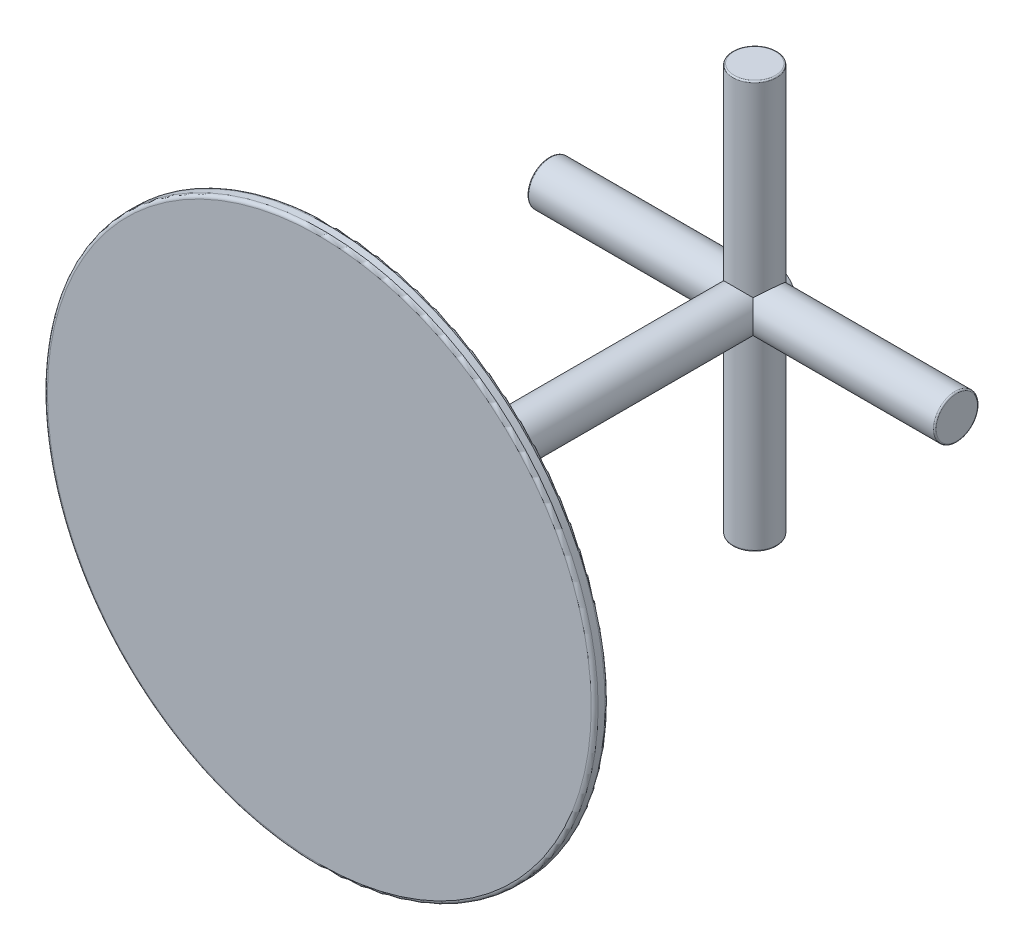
from build123d import *

# Parameters (mm, degrees)
SKETCH1_R           = 508
BASE_EXTRUDE_DEPTH  = 25.4
SKETCH5_R           = 40.64
BOSS_EXTRUDE1_DEPTH = 812.8
SKETCH6_R           = 40.64
BOSS_EXTRUDE2_DEPTH = 375.92
SKETCH7_R           = 40.64
BOSS_EXTRUDE3_DEPTH = 375.92
FILLET2_R           = 6.35
FILLET3_R           = 2.54


with BuildPart() as part:
    # Sketch1 → Base-Extrude (new body)
    with BuildSketch(Plane.XY):
        Circle(SKETCH1_R)
    extrude(amount=BASE_EXTRUDE_DEPTH)

    # Sketch5 → Boss-Extrude1 (add)
    with BuildSketch(Plane(origin=(0, 0, 0), x_dir=(-1, 0, 0), z_dir=(0, 0, -1))):
        with Locations(Location((0, 0, 0), (0, 0, 180))):
            Circle(SKETCH5_R)
    extrude(amount=BOSS_EXTRUDE1_DEPTH)

    # Sketch6 → Boss-Extrude2 (add, symmetric)
    with BuildSketch(Plane(origin=(0, 0, 0), x_dir=(0, 0, -1), z_dir=(1, 0, 0))):
        with Locations((774.71024772, 0)):
            Circle(SKETCH6_R)
    extrude(amount=BOSS_EXTRUDE2_DEPTH, both=True)

    # Sketch7 → Boss-Extrude3 (add, symmetric)
    with BuildSketch(Plane(origin=(0, 0, 0), x_dir=(1, 0, 0), z_dir=(0, 1, 0))):
        with Locations(Location((0, 777.887828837, 0), (0, 0, 270))):
            Circle(SKETCH7_R)
    extrude(amount=BOSS_EXTRUDE3_DEPTH, both=True)

    # Fillet2
    fillet2_edges = [part.edges().sort_by_distance(p)[0] for p in [
        (-508, 0, 0),
        (-508, 0, 25.4),
    ]]
    fillet(fillet2_edges, radius=FILLET2_R)

    # Fillet3
    fillet3_edges = [part.edges().sort_by_distance(p)[0] for p in [
        (-375.92, 0, -734.07024772),
        (375.92, 0, -734.07024772),
        (0, -375.92, -818.527828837),
        (0, 375.92, -818.527828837),
    ]]
    fillet(fillet3_edges, radius=FILLET3_R)


solid = part.part
